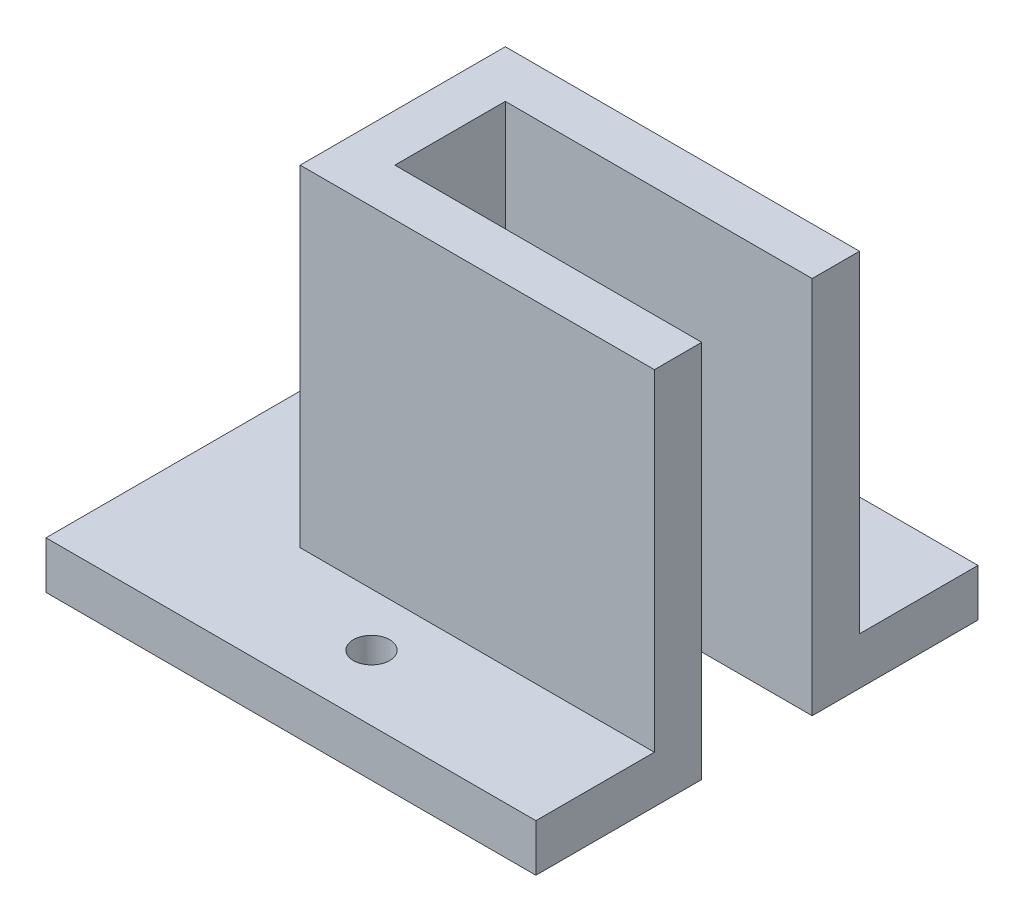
from build123d import *

# Parameters (mm, degrees)
SKETCH1_W           = 22.45
SKETCH1_H           = 13
BOSS_EXTRUDE1_DEPTH = 24
SKETCH2_W           = 8.225
SKETCH2_H           = 3.5
SKETCH2_W_2         = 3
CUT_EXTRUDE1_DEPTH  = 36.341229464
SKETCH3_W           = 13
SKETCH3_H           = 3
BOSS_EXTRUDE2_DEPTH = 8.6
SKETCH5_R           = 1.15
CUT_EXTRUDE2_DEPTH  = 34.376675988
SKETCH6_W           = 31.05
SKETCH6_H           = 3
BOSS_EXTRUDE3_DEPTH = 7.51
SKETCH7_R           = 1.15
CUT_EXTRUDE3_DEPTH  = 37.95487248
SKETCH8_R           = 1.15
CUT_EXTRUDE4_DEPTH  = 37.95487248


with BuildPart() as part:
    # Sketch1 → Boss-Extrude1 (new body)
    with BuildSketch(Plane(origin=(0, 0, 0), x_dir=(1, 0, 0), z_dir=(0, 1, 0))):
        with Locations((11.225, -6.5)):
            Rectangle(SKETCH1_W, SKETCH1_H)
    extrude(amount=BOSS_EXTRUDE1_DEPTH)

    # Sketch2 → Cut-Extrude1 (cut, through all)
    with BuildSketch(Plane(origin=(0, 0, 0), x_dir=(1, 0, 0), z_dir=(0, 1, 0))):
        with Locations((15.3375, -4.75)):
            Rectangle(SKETCH2_W, SKETCH2_H)
        with Locations((15.3375, -8.25)):
            Rectangle(SKETCH2_W, SKETCH2_H)
        with Locations((7.1125, -8.25)):
            Rectangle(SKETCH2_W, SKETCH2_H)
        with Locations((7.1125, -4.75)):
            Rectangle(SKETCH2_W, SKETCH2_H)
        with Locations((20.95, -4.75)):
            Rectangle(SKETCH2_W_2, SKETCH2_H)
        with Locations((20.95, -8.25)):
            Rectangle(SKETCH2_W_2, SKETCH2_H)
    extrude(amount=CUT_EXTRUDE1_DEPTH, mode=Mode.SUBTRACT)

    # Sketch3 → Boss-Extrude2 (add)
    with BuildSketch(Plane.ZY):
        with Locations((6.5, 1.5)):
            Rectangle(SKETCH3_W, SKETCH3_H)
    extrude(amount=BOSS_EXTRUDE2_DEPTH)

    # Sketch5 → Cut-Extrude2 (cut, through all)
    with BuildSketch(Plane(origin=(0, 3, 0), x_dir=(1, 0, 0), z_dir=(0, 1, 0))):
        with Locations(Location((-4.25, -6.22, 0), (0, 0, 270))):
            Circle(SKETCH5_R)
    extrude(amount=-CUT_EXTRUDE2_DEPTH, mode=Mode.SUBTRACT)

    # Sketch6 → Boss-Extrude3 (add)
    with BuildSketch(Plane.XY.offset(13)):
        with Locations((6.925, 1.5)):
            Rectangle(SKETCH6_W, SKETCH6_H)
    boss_extrude3 = extrude(amount=BOSS_EXTRUDE3_DEPTH)

    # Sketch7 → Cut-Extrude3 (cut, through all)
    with BuildSketch(Plane(origin=(0, 3, 0), x_dir=(1, 0, 0), z_dir=(0, 1, 0))):
        with Locations(Location((7.88, -16.36, 0), (0, 0, 270))):
            Circle(SKETCH7_R)
    extrude(amount=-CUT_EXTRUDE3_DEPTH, mode=Mode.SUBTRACT)

    # Mirror1: Boss-Extrude3 across plane
    add(boss_extrude3.mirror(Plane.XY.offset(6.5)))

    # Sketch8 → Cut-Extrude4 (cut, through all)
    with BuildSketch(Plane(origin=(0, 3, 0), x_dir=(1, 0, 0), z_dir=(0, 1, 0))):
        with Locations(Location((8.12, 3.64, 0), (0, 0, 270))):
            Circle(SKETCH8_R)
    extrude(amount=-CUT_EXTRUDE4_DEPTH, mode=Mode.SUBTRACT)


solid = part.part
